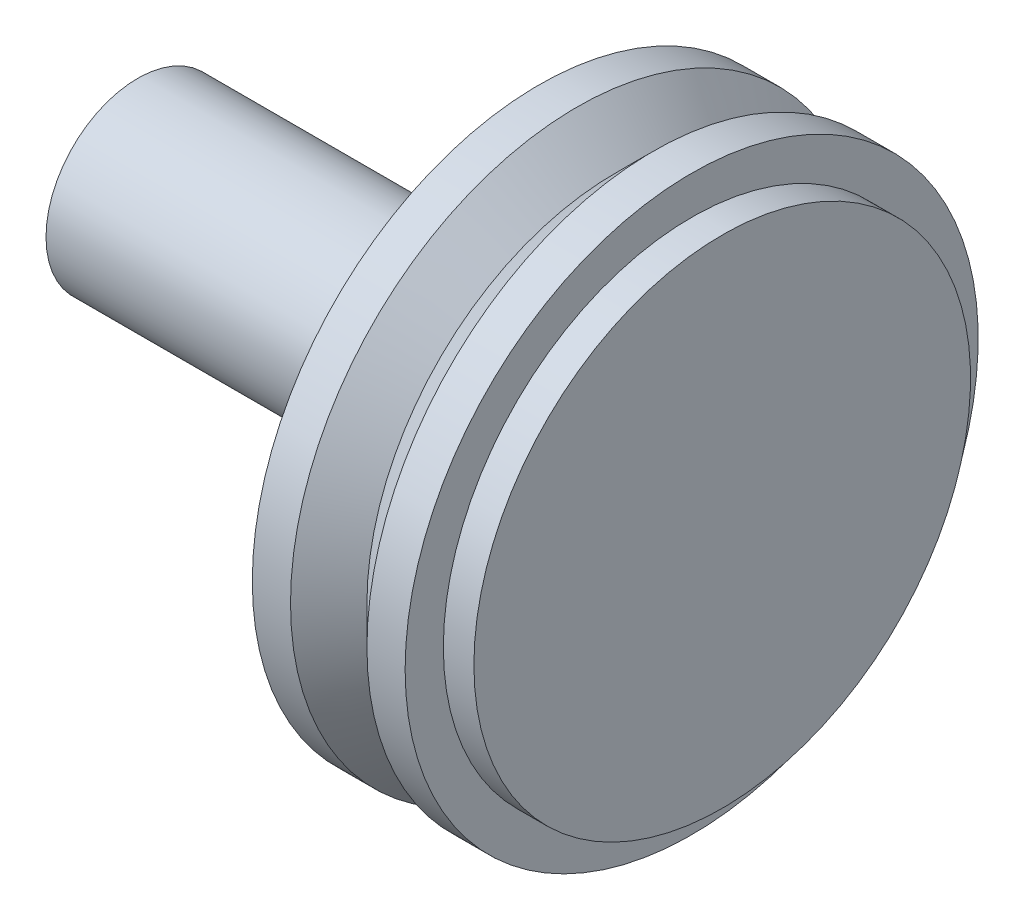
from build123d import *


with BuildPart() as part:
    # Sketch1 → Revolve1 (revolve)
    with BuildSketch(Plane.XY, mode=Mode.PRIVATE) as revolve1_sk:
        Polygon((145, -75), (135, -75), (125, -65), (115, -75), (105, -75), (105, -24), (0, -24), (0, 0), (153, 0), (153, -65), (145, -65), align=None)
    revolve(revolve1_sk.sketch.rotate(Axis((0, 0, 0), (1, 0, 0)), 270), axis=Axis((0, 0, 0), (1, 0, 0)))


solid = part.part
